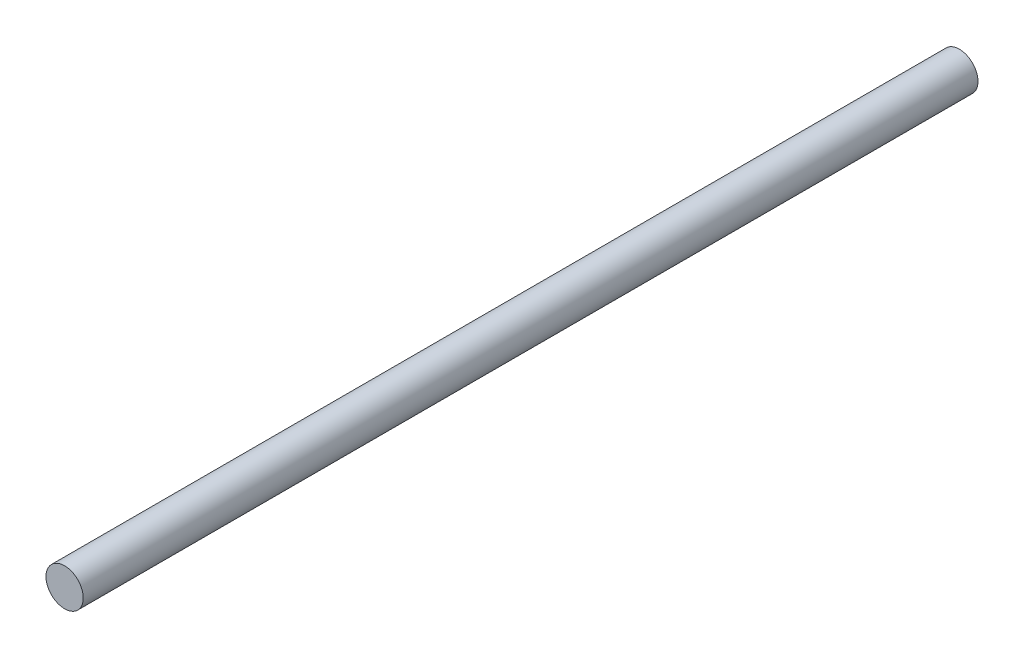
from build123d import *

# Parameters (mm, degrees)
ESQUISSE1_R        = 10
BOSS_EXTRU_1_DEPTH = 480


with BuildPart() as part:
    # Esquisse1 → Boss.-Extru.1 (new body)
    with BuildSketch(Plane.XY):
        Circle(ESQUISSE1_R)
    extrude(amount=BOSS_EXTRU_1_DEPTH)


solid = part.part
